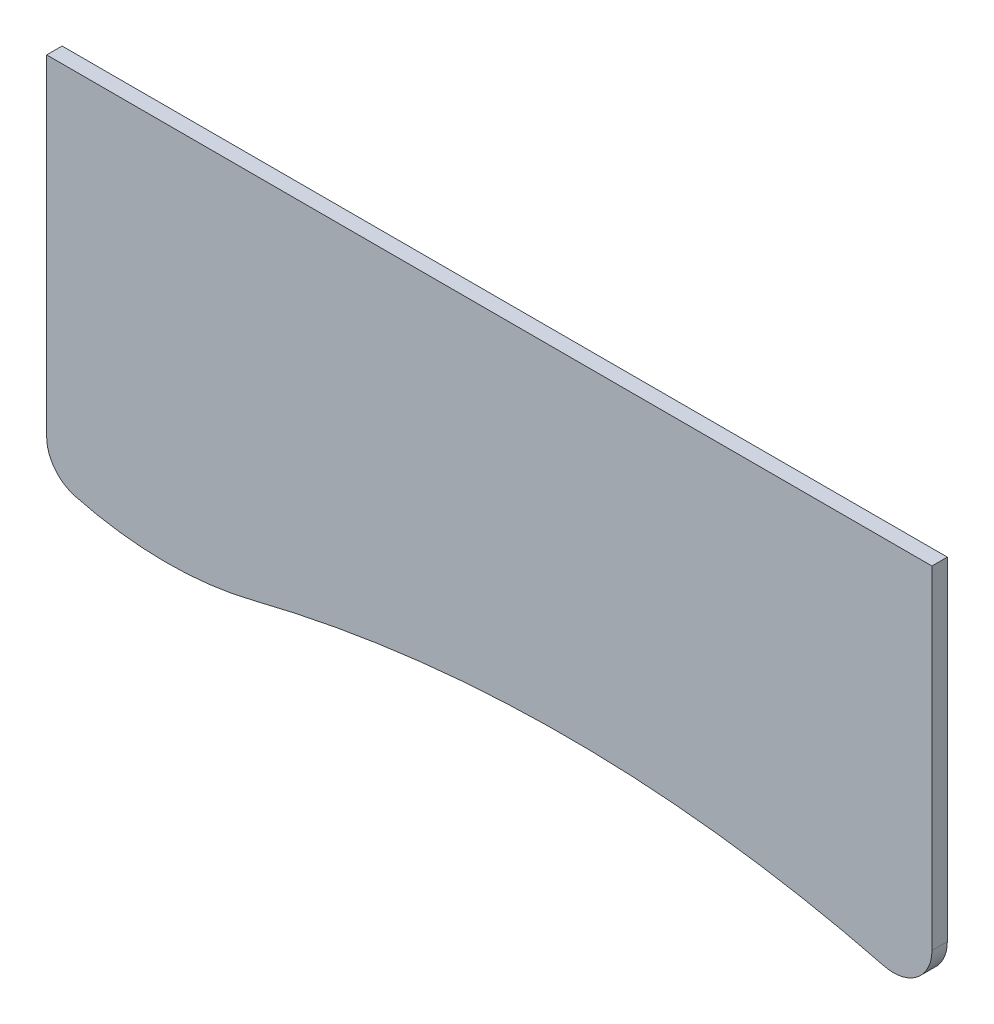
from build123d import *

# Parameters (mm, degrees)
SKETCH1_W           = 690
SKETCH1_H           = 300
BOSS_EXTRUDE1_DEPTH = 12
CUT_EXTRUDE1_DEPTH  = 753.491860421
FILLET1_R           = 30
FILLET2_R           = 30


with BuildPart() as part:
    # Sketch1 → Boss-Extrude1 (new body)
    with BuildSketch(Plane.XY):
        with Locations((345, 150)):
            Rectangle(SKETCH1_W, SKETCH1_H)
    extrude(amount=-BOSS_EXTRUDE1_DEPTH)

    # Sketch2 → Cut-Extrude1 (cut, through all)
    with BuildSketch(Plane.XY):
        with BuildLine():
            Line((0, 20.036846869), (0, -175.072391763))
            Line((0, -175.072391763), (858.014881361, -175.072391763))
            Line((858.014881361, -175.072391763), (858.014881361, -66.014574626))
            ThreePointArc((858.014881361, -66.014574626), (516.702015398, 36.238992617), (161.203809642, 12.337315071))
            ThreePointArc((161.203809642, 12.337315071), (80.031943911, 4.25390472), (0, 20.036846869))
        make_face()
    extrude(amount=-CUT_EXTRUDE1_DEPTH, mode=Mode.SUBTRACT)

    # Fillet1
    fillet1_edges = [part.edges().sort_by_distance(p)[0] for p in [
        (690, 1.017858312, -6),
    ]]
    fillet(fillet1_edges, radius=FILLET1_R)

    # Fillet2
    fillet2_edges = [part.edges().sort_by_distance(p)[0] for p in [
        (0, 20.036846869, -6),
    ]]
    fillet(fillet2_edges, radius=FILLET2_R)


solid = part.part
